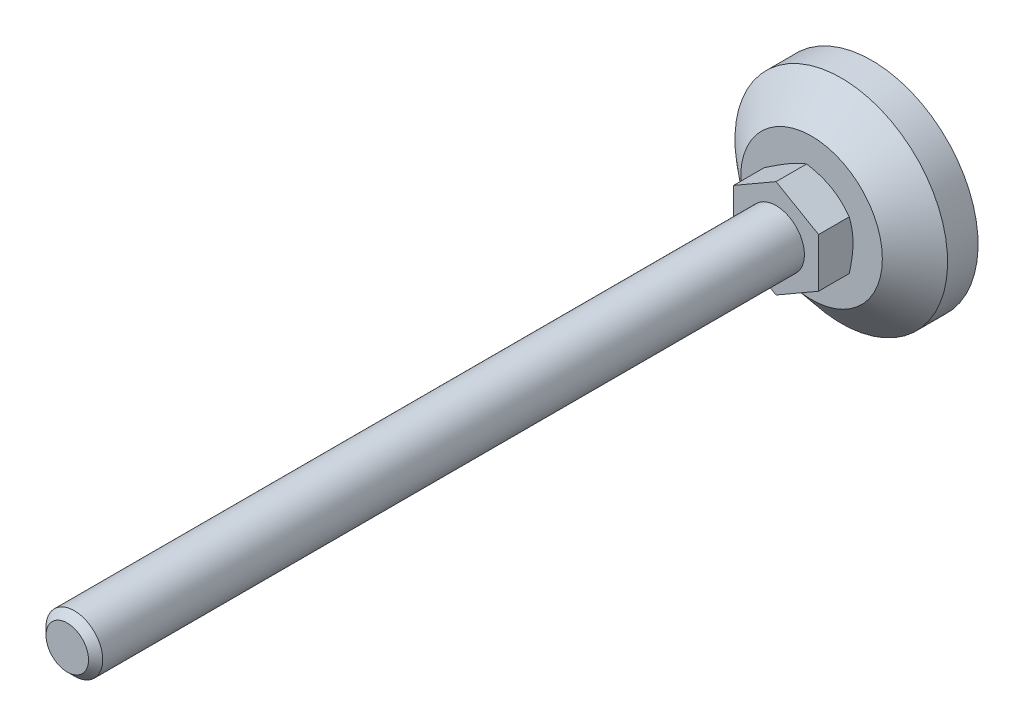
ISO-10303-21;
HEADER;
FILE_DESCRIPTION(('STEP AP214'),'2;1');
FILE_NAME('part.step','',(''),(''),'','','');
FILE_SCHEMA(('AUTOMOTIVE_DESIGN { 1 0 10303 214 1 1 1 1 }'));
ENDSEC;
DATA;
#1=APPLICATION_CONTEXT('core data for automotive mechanical design processes');
#2=APPLICATION_PROTOCOL_DEFINITION('international standard','automotive_design',2000,#1);
#3=PRODUCT_CONTEXT('',#1,'mechanical');
#4=PRODUCT('Part','Part','',(#3));
#5=PRODUCT_RELATED_PRODUCT_CATEGORY('part','',(#4));
#6=PRODUCT_DEFINITION_FORMATION('','',#4);
#7=PRODUCT_DEFINITION_CONTEXT('part definition',#1,'design');
#8=PRODUCT_DEFINITION('design','',#6,#7);
#9=PRODUCT_DEFINITION_SHAPE('','',#8);
#10=(LENGTH_UNIT() NAMED_UNIT(*) SI_UNIT(.MILLI.,.METRE.));
#11=(NAMED_UNIT(*) PLANE_ANGLE_UNIT() SI_UNIT($,.RADIAN.));
#12=(NAMED_UNIT(*) SI_UNIT($,.STERADIAN.) SOLID_ANGLE_UNIT());
#13=UNCERTAINTY_MEASURE_WITH_UNIT(LENGTH_MEASURE(1.E-05),#10,'distance_accuracy_value','');
#14=(GEOMETRIC_REPRESENTATION_CONTEXT(3) GLOBAL_UNCERTAINTY_ASSIGNED_CONTEXT((#13)) GLOBAL_UNIT_ASSIGNED_CONTEXT((#10,
#11,#12)) REPRESENTATION_CONTEXT('',''));
#15=CARTESIAN_POINT('',(0.,0.,0.));
#16=DIRECTION('',(0.,0.,1.));
#17=DIRECTION('',(1.,0.,0.));
#18=AXIS2_PLACEMENT_3D('',#15,#16,#17);
#19=CARTESIAN_POINT('',(0.,0.,27.));
#20=DIRECTION('',(0.,0.,1.));
#21=DIRECTION('',(0.5,-0.866025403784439,0.));
#22=AXIS2_PLACEMENT_3D('',#19,#20,#21);
#23=PLANE('',#22);
#24=DIRECTION('',(0.,1.,0.));
#25=VECTOR('',#24,1.);
#26=CARTESIAN_POINT('',(12.,-6.92820323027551,27.));
#27=LINE('',#26,#25);
#28=CARTESIAN_POINT('',(12.,-6.92820323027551,27.));
#29=VERTEX_POINT('',#28);
#30=CARTESIAN_POINT('',(12.,6.92820323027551,27.));
#31=VERTEX_POINT('',#30);
#32=EDGE_CURVE('E197',#29,#31,#27,.T.);
#33=ORIENTED_EDGE('',*,*,#32,.T.);
#34=DIRECTION('',(-0.866025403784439,0.5,0.));
#35=VECTOR('',#34,1.);
#36=CARTESIAN_POINT('',(12.,6.92820323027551,27.));
#37=LINE('',#36,#35);
#38=CARTESIAN_POINT('',(0.,13.856406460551,27.));
#39=VERTEX_POINT('',#38);
#40=EDGE_CURVE('E320',#31,#39,#37,.T.);
#41=ORIENTED_EDGE('',*,*,#40,.T.);
#42=DIRECTION('',(-0.866025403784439,-0.5,0.));
#43=VECTOR('',#42,1.);
#44=CARTESIAN_POINT('',(0.,13.856406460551,27.));
#45=LINE('',#44,#43);
#46=CARTESIAN_POINT('',(-12.,6.92820323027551,27.));
#47=VERTEX_POINT('',#46);
#48=EDGE_CURVE('E319',#39,#47,#45,.T.);
#49=ORIENTED_EDGE('',*,*,#48,.T.);
#50=DIRECTION('',(0.,-1.,0.));
#51=VECTOR('',#50,1.);
#52=CARTESIAN_POINT('',(-12.,6.92820323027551,27.));
#53=LINE('',#52,#51);
#54=CARTESIAN_POINT('',(-12.,-6.92820323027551,27.));
#55=VERTEX_POINT('',#54);
#56=EDGE_CURVE('E324',#47,#55,#53,.T.);
#57=ORIENTED_EDGE('',*,*,#56,.T.);
#58=DIRECTION('',(0.866025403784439,-0.5,0.));
#59=VECTOR('',#58,1.);
#60=CARTESIAN_POINT('',(-12.,-6.92820323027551,27.));
#61=LINE('',#60,#59);
#62=CARTESIAN_POINT('',(0.,-13.856406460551,27.));
#63=VERTEX_POINT('',#62);
#64=EDGE_CURVE('E326',#55,#63,#61,.T.);
#65=ORIENTED_EDGE('',*,*,#64,.T.);
#66=DIRECTION('',(0.866025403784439,0.5,0.));
#67=VECTOR('',#66,1.);
#68=CARTESIAN_POINT('',(0.,-13.856406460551,27.));
#69=LINE('',#68,#67);
#70=EDGE_CURVE('E37',#63,#29,#69,.T.);
#71=ORIENTED_EDGE('',*,*,#70,.T.);
#72=EDGE_LOOP('',(#33,#41,#49,#57,#65,#71));
#73=FACE_BOUND('',#72,.T.);
#74=CARTESIAN_POINT('',(0.,0.,27.));
#75=DIRECTION('',(0.,0.,1.));
#76=DIRECTION('',(0.5,-0.866025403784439,0.));
#77=AXIS2_PLACEMENT_3D('',#74,#75,#76);
#78=CIRCLE('',#77,8.);
#79=CARTESIAN_POINT('',(4.,-6.92820323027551,27.));
#80=VERTEX_POINT('',#79);
#81=EDGE_CURVE('E201',#80,#80,#78,.T.);
#82=ORIENTED_EDGE('',*,*,#81,.F.);
#83=EDGE_LOOP('',(#82));
#84=FACE_BOUND('',#83,.T.);
#85=ADVANCED_FACE('F14',(#73,#84),#23,.T.);
#86=CARTESIAN_POINT('',(-9.99463491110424,17.3112154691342,17.));
#87=DIRECTION('',(0.,0.,1.));
#88=DIRECTION('',(0.5,-0.866025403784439,0.));
#89=AXIS2_PLACEMENT_3D('',#86,#87,#88);
#90=PLANE('',#89);
#91=CARTESIAN_POINT('',(0.,0.,17.));
#92=DIRECTION('',(0.,0.,-1.));
#93=DIRECTION('',(-0.5,0.866025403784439,0.));
#94=AXIS2_PLACEMENT_3D('',#91,#92,#93);
#95=CIRCLE('',#94,19.9892698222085);
#96=CARTESIAN_POINT('',(-9.99463491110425,17.3112154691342,17.));
#97=VERTEX_POINT('',#96);
#98=EDGE_CURVE('E102',#97,#97,#95,.T.);
#99=ORIENTED_EDGE('',*,*,#98,.F.);
#100=EDGE_LOOP('',(#99));
#101=FACE_BOUND('',#100,.T.);
#102=CARTESIAN_POINT('',(0.,0.,17.));
#103=DIRECTION('',(0.,0.,-1.));
#104=DIRECTION('',(-0.5,0.866025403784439,0.));
#105=AXIS2_PLACEMENT_3D('',#102,#103,#104);
#106=CIRCLE('',#105,11.5);
#107=CARTESIAN_POINT('',(-5.75,9.95929214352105,17.));
#108=VERTEX_POINT('',#107);
#109=EDGE_CURVE('E84',#108,#108,#106,.T.);
#110=ORIENTED_EDGE('',*,*,#109,.T.);
#111=EDGE_LOOP('',(#110));
#112=FACE_BOUND('',#111,.T.);
#113=ADVANCED_FACE('F174',(#101,#112),#90,.T.);
#114=CARTESIAN_POINT('',(0.,0.,0.));
#115=DIRECTION('',(0.,0.,-1.));
#116=DIRECTION('',(-0.5,0.866025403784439,0.));
#117=AXIS2_PLACEMENT_3D('',#114,#115,#116);
#118=PLANE('',#117);
#119=CARTESIAN_POINT('',(0.,0.,0.));
#120=DIRECTION('',(0.,0.,-1.));
#121=DIRECTION('',(-0.5,0.866025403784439,0.));
#122=AXIS2_PLACEMENT_3D('',#119,#120,#121);
#123=CIRCLE('',#122,30.);
#124=CARTESIAN_POINT('',(-15.,25.9807621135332,0.));
#125=VERTEX_POINT('',#124);
#126=EDGE_CURVE('E73',#125,#125,#123,.T.);
#127=ORIENTED_EDGE('',*,*,#126,.T.);
#128=EDGE_LOOP('',(#127));
#129=FACE_BOUND('',#128,.T.);
#130=ADVANCED_FACE('F177',(#129),#118,.T.);
#131=CARTESIAN_POINT('',(0.,0.,-75.4972525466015));
#132=DIRECTION('',(0.,0.,-1.));
#133=DIRECTION('',(-0.5,0.866025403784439,0.));
#134=AXIS2_PLACEMENT_3D('',#131,#132,#133);
#135=CYLINDRICAL_SURFACE('',#134,30.);
#136=CARTESIAN_POINT('',(0.,0.,8.6));
#137=DIRECTION('',(0.,0.,-1.));
#138=DIRECTION('',(-0.5,0.866025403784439,0.));
#139=AXIS2_PLACEMENT_3D('',#136,#137,#138);
#140=CIRCLE('',#139,30.);
#141=CARTESIAN_POINT('',(-15.,25.9807621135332,8.6));
#142=VERTEX_POINT('',#141);
#143=EDGE_CURVE('E105',#142,#142,#140,.T.);
#144=ORIENTED_EDGE('',*,*,#143,.T.);
#145=EDGE_LOOP('',(#144));
#146=FACE_BOUND('',#145,.T.);
#147=ORIENTED_EDGE('',*,*,#126,.F.);
#148=EDGE_LOOP('',(#147));
#149=FACE_BOUND('',#148,.T.);
#150=ADVANCED_FACE('F181',(#146,#149),#135,.T.);
#151=CARTESIAN_POINT('',(0.,0.,8.6));
#152=DIRECTION('',(0.,0.,-1.));
#153=DIRECTION('',(-0.5,0.866025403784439,0.));
#154=AXIS2_PLACEMENT_3D('',#151,#152,#153);
#155=CONICAL_SURFACE('',#154,30.,0.872664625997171);
#156=ORIENTED_EDGE('',*,*,#98,.T.);
#157=EDGE_LOOP('',(#156));
#158=FACE_BOUND('',#157,.T.);
#159=ORIENTED_EDGE('',*,*,#143,.F.);
#160=EDGE_LOOP('',(#159));
#161=FACE_BOUND('',#160,.T.);
#162=ADVANCED_FACE('F121',(#158,#161),#155,.T.);
#163=CARTESIAN_POINT('',(0.,0.,20.8975219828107));
#164=DIRECTION('',(0.,0.,1.));
#165=DIRECTION('',(0.5,-0.866025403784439,0.));
#166=AXIS2_PLACEMENT_3D('',#163,#164,#165);
#167=CONICAL_SURFACE('',#166,18.2507060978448,1.0471975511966);
#168=ORIENTED_EDGE('',*,*,#109,.F.);
#169=EDGE_LOOP('',(#168));
#170=FACE_BOUND('',#169,.T.);
#171=CARTESIAN_POINT('',(-10.1845483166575,-19.7364581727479,23.1830146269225));
#172=CARTESIAN_POINT('',(-9.95731802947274,-19.6052667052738,23.0555465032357));
#173=CARTESIAN_POINT('',(-9.72982292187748,-19.4739223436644,22.9287081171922));
#174=CARTESIAN_POINT('',(-9.27424782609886,-19.2108959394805,22.6764332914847));
#175=CARTESIAN_POINT('',(-9.04616783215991,-19.0792138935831,22.5509968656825));
#176=CARTESIAN_POINT('',(-8.360907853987,-18.6835788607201,22.1769716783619));
#177=CARTESIAN_POINT('',(-7.90277404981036,-18.4190751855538,21.930704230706));
#178=CARTESIAN_POINT('',(-6.98100239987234,-17.8868900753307,21.4445247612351));
#179=CARTESIAN_POINT('',(-6.51734820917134,-17.6191992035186,21.2046539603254));
#180=CARTESIAN_POINT('',(-5.58637620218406,-17.0817022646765,20.734620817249));
#181=CARTESIAN_POINT('',(-5.11905855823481,-16.8118962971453,20.5044580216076));
#182=CARTESIAN_POINT('',(-4.16467967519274,-16.2608853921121,20.0490896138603));
#183=CARTESIAN_POINT('',(-3.67747196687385,-15.9795958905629,19.82429119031));
#184=CARTESIAN_POINT('',(-2.69737824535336,-15.413738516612,19.3915182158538));
#185=CARTESIAN_POINT('',(-2.20449160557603,-15.1291702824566,19.1835455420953));
#186=CARTESIAN_POINT('',(-1.21317256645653,-14.5568319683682,18.7898295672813));
#187=CARTESIAN_POINT('',(-0.714753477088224,-14.2690695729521,18.6040419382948));
#188=CARTESIAN_POINT('',(0.289281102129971,-13.6893899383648,18.2605950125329));
#189=CARTESIAN_POINT('',(0.794894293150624,-13.3974740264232,18.1029269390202));
#190=CARTESIAN_POINT('',(1.55740346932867,-12.9572391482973,17.8936125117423));
#191=CARTESIAN_POINT('',(1.81154649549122,-12.8105096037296,17.82851512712));
#192=CARTESIAN_POINT('',(2.3215816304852,-12.5160406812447,17.7081511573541));
#193=CARTESIAN_POINT('',(2.57747370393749,-12.3683013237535,17.652884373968));
#194=CARTESIAN_POINT('',(3.09083535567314,-12.0719118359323,17.5531523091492));
#195=CARTESIAN_POINT('',(3.34830490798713,-11.9232617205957,17.5086868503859));
#196=CARTESIAN_POINT('',(3.86455433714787,-11.6252049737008,17.4314414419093));
#197=CARTESIAN_POINT('',(4.12333416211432,-11.4757983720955,17.3986610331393));
#198=CARTESIAN_POINT('',(4.63843364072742,-11.1784055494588,17.345852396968));
#199=CARTESIAN_POINT('',(4.89474072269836,-11.0304265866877,17.3256616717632));
#200=CARTESIAN_POINT('',(5.40786438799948,-10.7341745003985,17.2978182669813));
#201=CARTESIAN_POINT('',(5.66468096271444,-10.5859013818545,17.2901653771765));
#202=CARTESIAN_POINT('',(6.17836497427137,-10.2893257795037,17.287579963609));
#203=CARTESIAN_POINT('',(6.43523241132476,-10.1410232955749,17.2926474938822));
#204=CARTESIAN_POINT('',(6.94855188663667,-9.84465815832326,17.3153783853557));
#205=CARTESIAN_POINT('',(7.20500390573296,-9.69659551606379,17.3330423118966));
#206=CARTESIAN_POINT('',(7.81927447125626,-9.34194623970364,17.3900614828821));
#207=CARTESIAN_POINT('',(8.17669346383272,-9.13559028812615,17.4352607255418));
#208=CARTESIAN_POINT('',(8.88892563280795,-8.72438285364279,17.5476838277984));
#209=CARTESIAN_POINT('',(9.24373845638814,-8.51953157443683,17.6149106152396));
#210=CARTESIAN_POINT('',(9.95040329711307,-8.11153843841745,17.7689975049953));
#211=CARTESIAN_POINT('',(10.3022528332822,-7.90839801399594,17.8558726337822));
#212=CARTESIAN_POINT('',(11.0024455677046,-7.50414155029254,18.0466010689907));
#213=CARTESIAN_POINT('',(11.3507888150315,-7.30302548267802,18.1504541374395));
#214=CARTESIAN_POINT('',(12.0517118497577,-6.89834737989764,18.3750877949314));
#215=CARTESIAN_POINT('',(12.4042127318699,-6.69483090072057,18.4961943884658));
#216=CARTESIAN_POINT('',(13.1057427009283,-6.28980238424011,18.7510771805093));
#217=CARTESIAN_POINT('',(13.4547717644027,-6.08829036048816,18.8848534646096));
#218=CARTESIAN_POINT('',(14.1495287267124,-5.68717224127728,19.1629377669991));
#219=CARTESIAN_POINT('',(14.4952576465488,-5.48756555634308,19.3072424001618));
#220=CARTESIAN_POINT('',(15.1838410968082,-5.09001171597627,19.6046702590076));
#221=CARTESIAN_POINT('',(15.5266956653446,-4.89206453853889,19.7577933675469));
#222=CARTESIAN_POINT('',(16.3531119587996,-4.41493286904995,20.1371587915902));
#223=CARTESIAN_POINT('',(16.8353860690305,-4.13649178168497,20.3671360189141));
#224=CARTESIAN_POINT('',(17.7956874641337,-3.58206151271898,20.838658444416));
#225=CARTESIAN_POINT('',(18.2737144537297,-3.3060725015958,21.0802044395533));
#226=CARTESIAN_POINT('',(19.2263411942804,-2.75607319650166,21.572480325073));
#227=CARTESIAN_POINT('',(19.7009400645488,-2.48206341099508,21.8232124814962));
#228=CARTESIAN_POINT('',(20.647182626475,-1.93575001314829,22.3319518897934));
#229=CARTESIAN_POINT('',(21.1188263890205,-1.66344635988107,22.5899589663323));
#230=CARTESIAN_POINT('',(22.060219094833,-1.11993302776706,23.1121588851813));
#231=CARTESIAN_POINT('',(22.5299651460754,-0.848725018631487,23.3763586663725));
#232=CARTESIAN_POINT('',(23.4674052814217,-0.307493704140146,23.9095679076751));
#233=CARTESIAN_POINT('',(23.9350993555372,-0.037470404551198,24.1785773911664));
#234=CARTESIAN_POINT('',(24.8686924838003,0.50153983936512,24.7205226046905));
#235=CARTESIAN_POINT('',(25.3345917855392,0.770526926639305,24.9934577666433));
#236=CARTESIAN_POINT('',(26.2649273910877,1.30765643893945,25.5426344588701));
#237=CARTESIAN_POINT('',(26.7293636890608,1.57579886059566,25.8188760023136));
#238=CARTESIAN_POINT('',(28.0397530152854,2.33235249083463,26.6032315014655));
#239=CARTESIAN_POINT('',(28.8842584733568,2.81992794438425,27.1145698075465));
#240=CARTESIAN_POINT('',(30.5701660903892,3.79328716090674,28.1440983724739));
#241=CARTESIAN_POINT('',(31.4115681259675,4.27907085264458,28.6622889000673));
#242=CARTESIAN_POINT('',(33.0897202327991,5.24795242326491,29.7025139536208));
#243=CARTESIAN_POINT('',(33.9264767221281,5.73105400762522,30.2245346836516));
#244=CARTESIAN_POINT('',(35.1801565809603,6.45486641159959,31.0105887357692));
#245=CARTESIAN_POINT('',(35.5977953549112,6.69599027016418,31.2731029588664));
#246=CARTESIAN_POINT('',(36.4326440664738,7.17799039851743,31.7990373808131));
#247=CARTESIAN_POINT('',(36.8498540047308,7.41886666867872,32.0624575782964));
#248=CARTESIAN_POINT('',(37.2668741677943,7.65963337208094,32.3262778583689));
#249=B_SPLINE_CURVE_WITH_KNOTS('',3,(#171,#172,#173,#174,#175,#176,#177,#178,#179,#180,#181,
#182,#183,#184,#185,#186,#187,#188,#189,#190,#191,#192,#193,#194,#195,#196,#197,#198,#199,#200,
#201,#202,#203,#204,#205,#206,#207,#208,#209,#210,#211,#212,#213,#214,#215,#216,#217,#218,#219,
#220,#221,#222,#223,#224,#225,#226,#227,#228,#229,#230,#231,#232,#233,#234,#235,#236,#237,#238,
#239,#240,#241,#242,#243,#244,#245,#246,#247,#248),.UNSPECIFIED.,.F.,.F.,(4,2,2,2,2,2,2,2,2,2,2,
2,2,2,2,2,2,2,2,2,2,2,2,2,2,2,2,2,2,2,2,2,2,2,2,2,2,2,4),(0.,0.875119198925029,1.75024704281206,
3.50075771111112,5.26066680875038,7.02049360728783,8.8377767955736,10.6552624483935,
12.469053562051,14.2822775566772,15.1839173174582,16.085538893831,16.9871456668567,
17.8887170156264,18.7783966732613,19.6680614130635,20.5577299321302,21.4474383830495,
22.6922901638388,23.9373074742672,25.1832801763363,26.4292354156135,27.7029922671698,
28.9767577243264,30.2501154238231,31.5234562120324,33.3307782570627,35.1382249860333,
36.9461206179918,38.7539727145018,40.5639577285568,42.3739515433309,44.1836860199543,
45.9934277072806,49.2966384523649,52.5999791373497,55.8945808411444,57.5417866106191,
59.1889898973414),.UNSPECIFIED.);
#250=CARTESIAN_POINT('',(0.,-13.856406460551,18.3604719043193));
#251=VERTEX_POINT('',#250);
#252=CARTESIAN_POINT('',(12.,-6.92820323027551,18.3604719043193));
#253=VERTEX_POINT('',#252);
#254=EDGE_CURVE('E65',#251,#253,#249,.T.);
#255=ORIENTED_EDGE('',*,*,#254,.F.);
#256=CARTESIAN_POINT('',(-12.0002,-6.92808776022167,18.3605385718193));
#257=CARTESIAN_POINT('',(-11.7364142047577,-7.08038456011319,18.2726247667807));
#258=CARTESIAN_POINT('',(-11.4716448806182,-7.2332492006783,18.1887011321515));
#259=CARTESIAN_POINT('',(-10.9399829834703,-7.54020434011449,18.0299413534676));
#260=CARTESIAN_POINT('',(-10.6730897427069,-7.69429522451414,17.9551081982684));
#261=CARTESIAN_POINT('',(-9.86810959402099,-8.15905073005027,17.7456926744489));
#262=CARTESIAN_POINT('',(-9.3268449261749,-8.47155003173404,17.6265783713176));
#263=CARTESIAN_POINT('',(-8.51686717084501,-8.93919090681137,17.4869061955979));
#264=CARTESIAN_POINT('',(-8.25057389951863,-9.09293539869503,17.4471189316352));
#265=CARTESIAN_POINT('',(-7.71675440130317,-9.40113622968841,17.3803985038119));
#266=CARTESIAN_POINT('',(-7.44922815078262,-9.55559258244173,17.3534655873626));
#267=CARTESIAN_POINT('',(-6.91372963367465,-9.86476279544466,17.3131437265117));
#268=CARTESIAN_POINT('',(-6.64575827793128,-10.0194761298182,17.2997386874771));
#269=CARTESIAN_POINT('',(-6.10956726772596,-10.3290461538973,17.286758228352));
#270=CARTESIAN_POINT('',(-5.84134762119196,-10.4839028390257,17.2871823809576));
#271=CARTESIAN_POINT('',(-5.33991062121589,-10.7734076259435,17.3008951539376));
#272=CARTESIAN_POINT('',(-5.10665750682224,-10.908076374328,17.3125111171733));
#273=CARTESIAN_POINT('',(-4.64068775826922,-11.1771041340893,17.3459831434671));
#274=CARTESIAN_POINT('',(-4.40797116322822,-11.3114631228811,17.367839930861));
#275=CARTESIAN_POINT('',(-3.94320092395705,-11.5797983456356,17.4214125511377));
#276=CARTESIAN_POINT('',(-3.71114798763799,-11.7137741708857,17.4531365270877));
#277=CARTESIAN_POINT('',(-3.24813003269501,-11.9810977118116,17.5258869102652));
#278=CARTESIAN_POINT('',(-3.01716508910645,-12.1144453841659,17.566913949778));
#279=CARTESIAN_POINT('',(-2.31605804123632,-12.5192297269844,17.7049867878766));
#280=CARTESIAN_POINT('',(-1.84794625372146,-12.789494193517,17.8158000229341));
#281=CARTESIAN_POINT('',(-0.918702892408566,-13.3259930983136,18.0673009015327));
#282=CARTESIAN_POINT('',(-0.457559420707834,-13.5922344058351,18.2079294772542));
#283=CARTESIAN_POINT('',(0.000200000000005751,-13.8565219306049,18.3605385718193));
#284=B_SPLINE_CURVE_WITH_KNOTS('',3,(#256,#257,#258,#259,#260,#261,#262,#263,#264,#265,#266,
#267,#268,#269,#270,#271,#272,#273,#274,#275,#276,#277,#278,#279,#280,#281,#282,#283),
.UNSPECIFIED.,.F.,.F.,(4,2,2,2,2,2,2,2,2,2,2,2,2,4),(0.,0.951004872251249,1.90232158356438,
3.80900466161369,4.73894551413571,5.6689042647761,6.59775529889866,7.52657763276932,
8.3351464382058,9.14377244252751,9.95306755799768,10.7624176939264,12.4167102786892,
14.0677556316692),.UNSPECIFIED.);
#285=CARTESIAN_POINT('',(-12.,-6.92820323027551,18.3604719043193));
#286=VERTEX_POINT('',#285);
#287=EDGE_CURVE('E68',#286,#251,#284,.T.);
#288=ORIENTED_EDGE('',*,*,#287,.F.);
#289=CARTESIAN_POINT('',(-12.,6.92843417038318,18.3605385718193));
#290=CARTESIAN_POINT('',(-12.,6.62384057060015,18.2726247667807));
#291=CARTESIAN_POINT('',(-12.,6.31811128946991,18.1887011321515));
#292=CARTESIAN_POINT('',(-12.,5.70420101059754,18.0299413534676));
#293=CARTESIAN_POINT('',(-12.,5.39601924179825,17.9551081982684));
#294=CARTESIAN_POINT('',(-12.,4.46650823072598,17.7456926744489));
#295=CARTESIAN_POINT('',(-12.,3.84150962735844,17.6265783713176));
#296=CARTESIAN_POINT('',(-12.,2.90622787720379,17.4869061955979));
#297=CARTESIAN_POINT('',(-12.,2.59873889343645,17.4471189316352));
#298=CARTESIAN_POINT('',(-12.,1.98233723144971,17.3803985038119));
#299=CARTESIAN_POINT('',(-12.,1.67342452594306,17.3534655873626));
#300=CARTESIAN_POINT('',(-12.,1.05508409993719,17.3131437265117));
#301=CARTESIAN_POINT('',(-12.,0.745657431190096,17.2997386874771));
#302=CARTESIAN_POINT('',(-12.,0.126517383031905,17.286758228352));
#303=CARTESIAN_POINT('',(-12.,-0.183195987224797,17.2871823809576));
#304=CARTESIAN_POINT('',(-12.,-0.76220556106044,17.3008951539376));
#305=CARTESIAN_POINT('',(-12.,-1.03154305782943,17.3125111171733));
#306=CARTESIAN_POINT('',(-12.,-1.56959857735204,17.3459831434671));
#307=CARTESIAN_POINT('',(-12.,-1.83831655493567,17.367839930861));
#308=CARTESIAN_POINT('',(-12.,-2.37498700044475,17.4214125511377));
#309=CARTESIAN_POINT('',(-12.,-2.64293865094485,17.4531365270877));
#310=CARTESIAN_POINT('',(-12.,-3.17758573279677,17.5258869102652));
#311=CARTESIAN_POINT('',(-12.,-3.44428107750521,17.566913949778));
#312=CARTESIAN_POINT('',(-12.,-4.25384976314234,17.7049867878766));
#313=CARTESIAN_POINT('',(-12.,-4.79437869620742,17.8158000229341));
#314=CARTESIAN_POINT('',(-12.,-5.86737650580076,18.0673009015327));
#315=CARTESIAN_POINT('',(-12.,-6.39985912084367,18.2079294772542));
#316=CARTESIAN_POINT('',(-12.,-6.92843417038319,18.3605385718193));
#317=B_SPLINE_CURVE_WITH_KNOTS('',3,(#289,#290,#291,#292,#293,#294,#295,#296,#297,#298,#299,
#300,#301,#302,#303,#304,#305,#306,#307,#308,#309,#310,#311,#312,#313,#314,#315,#316),
.UNSPECIFIED.,.F.,.F.,(4,2,2,2,2,2,2,2,2,2,2,2,2,4),(0.,0.951004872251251,1.90232158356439,
3.80900466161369,4.73894551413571,5.6689042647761,6.59775529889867,7.52657763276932,
8.3351464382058,9.14377244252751,9.95306755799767,10.7624176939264,12.4167102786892,
14.0677556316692),.UNSPECIFIED.);
#318=CARTESIAN_POINT('',(-12.,6.92820323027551,18.3604719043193));
#319=VERTEX_POINT('',#318);
#320=EDGE_CURVE('E83',#319,#286,#317,.T.);
#321=ORIENTED_EDGE('',*,*,#320,.F.);
#322=CARTESIAN_POINT('',(-22.184548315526,1.04815151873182,23.1830146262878));
#323=CARTESIAN_POINT('',(-21.9573180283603,1.179342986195,23.0555465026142));
#324=CARTESIAN_POINT('',(-21.729822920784,1.31068734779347,22.9287081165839));
#325=CARTESIAN_POINT('',(-21.2742478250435,1.57371375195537,22.676433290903));
#326=CARTESIAN_POINT('',(-21.0461678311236,1.7053957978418,22.550996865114));
#327=CARTESIAN_POINT('',(-20.3609078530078,2.1010308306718,22.1769716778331));
#328=CARTESIAN_POINT('',(-19.9027740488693,2.36553450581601,21.9307042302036));
#329=CARTESIAN_POINT('',(-18.9810023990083,2.89771961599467,21.4445247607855));
#330=CARTESIAN_POINT('',(-18.517348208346,3.16541048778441,21.2046539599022));
#331=CARTESIAN_POINT('',(-17.5863762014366,3.7029074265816,20.7346208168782));
#332=CARTESIAN_POINT('',(-17.1190585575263,3.97271339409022,20.5044580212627));
#333=CARTESIAN_POINT('',(-16.1646796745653,4.52372429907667,20.0490896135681));
#334=CARTESIAN_POINT('',(-15.6774719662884,4.80501380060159,19.8242911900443));
#335=CARTESIAN_POINT('',(-14.6973782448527,5.37087117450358,19.3915182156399));
#336=CARTESIAN_POINT('',(-14.2044916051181,5.65543940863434,19.1835455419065));
#337=CARTESIAN_POINT('',(-13.2131725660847,6.22777772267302,18.7898295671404));
#338=CARTESIAN_POINT('',(-12.7147534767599,6.51554011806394,18.6040419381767));
#339=CARTESIAN_POINT('',(-11.7107188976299,7.09521975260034,18.2605950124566));
#340=CARTESIAN_POINT('',(-11.2051057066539,7.38713566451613,18.1029269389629));
#341=CARTESIAN_POINT('',(-10.4425965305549,7.82737054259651,17.8936125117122));
#342=CARTESIAN_POINT('',(-10.1884535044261,7.97410008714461,17.8285151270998));
#343=CARTESIAN_POINT('',(-9.67841836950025,8.26856900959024,17.7081511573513));
#344=CARTESIAN_POINT('',(-9.42252629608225,8.41630836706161,17.6528843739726));
#345=CARTESIAN_POINT('',(-8.90916464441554,8.71269785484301,17.5531523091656));
#346=CARTESIAN_POINT('',(-8.6516950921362,8.86134797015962,17.5086868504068));
#347=CARTESIAN_POINT('',(-8.13544566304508,9.15940471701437,17.4314414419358));
#348=CARTESIAN_POINT('',(-7.87666583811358,9.30881131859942,17.3986610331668));
#349=CARTESIAN_POINT('',(-7.36156635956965,9.60620414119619,17.3458523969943));
#350=CARTESIAN_POINT('',(-7.10525927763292,9.75418310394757,17.3256616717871));
#351=CARTESIAN_POINT('',(-6.59213561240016,10.0504351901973,17.2978182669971));
#352=CARTESIAN_POINT('',(-6.33531903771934,10.1987083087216,17.2901653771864));
#353=CARTESIAN_POINT('',(-5.82163502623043,10.4952839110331,17.2875799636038));
#354=CARTESIAN_POINT('',(-5.56476758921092,10.6435863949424,17.2926474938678));
#355=CARTESIAN_POINT('',(-5.05144811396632,10.9399515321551,17.3153783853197));
#356=CARTESIAN_POINT('',(-4.79499609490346,11.0880141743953,17.3330423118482));
#357=CARTESIAN_POINT('',(-4.18072552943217,11.4426634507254,17.3900614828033));
#358=CARTESIAN_POINT('',(-3.82330653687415,11.6490194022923,17.4352607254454));
#359=CARTESIAN_POINT('',(-3.11107436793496,12.0602268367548,17.547683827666));
#360=CARTESIAN_POINT('',(-2.75626154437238,12.2650781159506,17.6149106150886));
#361=CARTESIAN_POINT('',(-2.04959670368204,12.67307125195,17.768997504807));
#362=CARTESIAN_POINT('',(-1.69774716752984,12.8762116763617,17.8558726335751));
#363=CARTESIAN_POINT('',(-0.997554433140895,13.2804681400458,18.0466010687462));
#364=CARTESIAN_POINT('',(-0.649211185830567,13.4815842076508,18.1504541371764));
#365=CARTESIAN_POINT('',(0.0517118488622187,13.8862623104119,18.3750877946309));
#366=CARTESIAN_POINT('',(0.404212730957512,14.0897787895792,18.4961943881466));
#367=CARTESIAN_POINT('',(1.10574269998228,14.4948073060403,18.7510771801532));
#368=CARTESIAN_POINT('',(1.45477176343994,14.6963193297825,18.8848534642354));
#369=CARTESIAN_POINT('',(2.1495287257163,15.0974374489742,19.1629377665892));
#370=CARTESIAN_POINT('',(2.49525764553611,15.2970441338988,19.3072423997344));
#371=CARTESIAN_POINT('',(3.18384109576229,15.6945979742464,19.6046702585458));
#372=CARTESIAN_POINT('',(3.52669566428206,15.8925451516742,19.7577933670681));
#373=CARTESIAN_POINT('',(4.3531119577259,16.3696768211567,20.1371587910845));
#374=CARTESIAN_POINT('',(4.83538606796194,16.6481179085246,20.3671360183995));
#375=CARTESIAN_POINT('',(5.7956874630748,17.2025481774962,20.838658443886));
#376=CARTESIAN_POINT('',(6.27371445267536,17.478537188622,21.0802044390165));
#377=CARTESIAN_POINT('',(7.22634119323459,18.0285364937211,21.5724803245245));
#378=CARTESIAN_POINT('',(7.7009400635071,18.30254627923,21.8232124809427));
#379=CARTESIAN_POINT('',(8.64718262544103,18.8488596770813,22.3319518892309));
#380=CARTESIAN_POINT('',(9.11882638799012,19.1211633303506,22.589958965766));
#381=CARTESIAN_POINT('',(10.0602190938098,19.6646766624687,23.1121588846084));
#382=CARTESIAN_POINT('',(10.5299651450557,19.9358846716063,23.3763586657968));
#383=CARTESIAN_POINT('',(11.4674052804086,20.4771159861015,23.9095679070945));
#384=CARTESIAN_POINT('',(11.9350993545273,20.7471392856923,24.1785773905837));
#385=CARTESIAN_POINT('',(12.8686924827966,21.2861495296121,24.7205226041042));
#386=CARTESIAN_POINT('',(13.3345917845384,21.555136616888,24.9934577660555));
#387=CARTESIAN_POINT('',(14.2649273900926,22.0922661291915,25.5426344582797));
#388=CARTESIAN_POINT('',(14.7293636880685,22.3604085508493,25.8188760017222));
#389=CARTESIAN_POINT('',(16.0397530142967,23.1169621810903,26.6032315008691));
#390=CARTESIAN_POINT('',(16.8842584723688,23.6045376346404,27.1145698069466));
#391=CARTESIAN_POINT('',(18.5701660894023,24.5778968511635,28.1440983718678));
#392=CARTESIAN_POINT('',(19.411568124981,25.0636805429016,28.6622888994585));
#393=CARTESIAN_POINT('',(21.0897202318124,26.0325621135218,29.7025139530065));
#394=CARTESIAN_POINT('',(21.9264767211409,26.5156636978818,30.2245346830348));
#395=CARTESIAN_POINT('',(23.1801565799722,27.2394761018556,31.0105887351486));
#396=CARTESIAN_POINT('',(23.5977953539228,27.48059996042,31.2731029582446));
#397=CARTESIAN_POINT('',(24.4326440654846,27.9626000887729,31.799037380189));
#398=CARTESIAN_POINT('',(24.8498540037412,28.2034763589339,32.0624575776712));
#399=CARTESIAN_POINT('',(25.2668741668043,28.4442430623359,32.3262778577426));
#400=B_SPLINE_CURVE_WITH_KNOTS('',3,(#322,#323,#324,#325,#326,#327,#328,#329,#330,#331,#332,
#333,#334,#335,#336,#337,#338,#339,#340,#341,#342,#343,#344,#345,#346,#347,#348,#349,#350,#351,
#352,#353,#354,#355,#356,#357,#358,#359,#360,#361,#362,#363,#364,#365,#366,#367,#368,#369,#370,
#371,#372,#373,#374,#375,#376,#377,#378,#379,#380,#381,#382,#383,#384,#385,#386,#387,#388,#389,
#390,#391,#392,#393,#394,#395,#396,#397,#398,#399),.UNSPECIFIED.,.F.,.F.,(4,2,2,2,2,2,2,2,2,2,2,
2,2,2,2,2,2,2,2,2,2,2,2,2,2,2,2,2,2,2,2,2,2,2,2,2,2,2,4),(0.,0.875119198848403,1.7502470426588,
3.50075771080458,5.2606668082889,7.02049360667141,8.83777679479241,10.6552624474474,
12.4690535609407,14.2822775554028,15.183917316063,16.085538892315,16.9871456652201,
17.8887170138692,18.7783966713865,19.668061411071,20.55772993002,21.4474383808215,
22.6922901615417,23.9373074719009,25.1832801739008,26.4292354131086,27.7029922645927,
28.9767577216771,30.2501154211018,31.523456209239,33.3307782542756,35.1382249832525,
36.9461206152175,38.7539727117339,40.5639577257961,42.3739515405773,44.1836860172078,
45.9934277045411,49.2966384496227,52.5999791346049,55.8945808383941,57.541786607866,
59.1889898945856),.UNSPECIFIED.);
#401=CARTESIAN_POINT('',(0.,13.856406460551,18.3604719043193));
#402=VERTEX_POINT('',#401);
#403=EDGE_CURVE('E143',#402,#319,#400,.F.);
#404=ORIENTED_EDGE('',*,*,#403,.F.);
#405=CARTESIAN_POINT('',(12.0002,6.92808776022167,18.3605385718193));
#406=CARTESIAN_POINT('',(11.7364142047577,7.08038456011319,18.2726247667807));
#407=CARTESIAN_POINT('',(11.4716448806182,7.2332492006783,18.1887011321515));
#408=CARTESIAN_POINT('',(10.9399829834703,7.54020434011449,18.0299413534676));
#409=CARTESIAN_POINT('',(10.6730897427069,7.69429522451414,17.9551081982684));
#410=CARTESIAN_POINT('',(9.86810959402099,8.15905073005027,17.7456926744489));
#411=CARTESIAN_POINT('',(9.3268449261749,8.47155003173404,17.6265783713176));
#412=CARTESIAN_POINT('',(8.51686717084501,8.93919090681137,17.4869061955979));
#413=CARTESIAN_POINT('',(8.25057389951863,9.09293539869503,17.4471189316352));
#414=CARTESIAN_POINT('',(7.71675440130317,9.40113622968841,17.3803985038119));
#415=CARTESIAN_POINT('',(7.44922815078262,9.55559258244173,17.3534655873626));
#416=CARTESIAN_POINT('',(6.91372963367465,9.86476279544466,17.3131437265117));
#417=CARTESIAN_POINT('',(6.64575827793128,10.0194761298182,17.2997386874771));
#418=CARTESIAN_POINT('',(6.10956726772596,10.3290461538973,17.286758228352));
#419=CARTESIAN_POINT('',(5.84134762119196,10.4839028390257,17.2871823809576));
#420=CARTESIAN_POINT('',(5.33991062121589,10.7734076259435,17.3008951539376));
#421=CARTESIAN_POINT('',(5.10665750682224,10.908076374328,17.3125111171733));
#422=CARTESIAN_POINT('',(4.64068775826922,11.1771041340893,17.3459831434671));
#423=CARTESIAN_POINT('',(4.40797116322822,11.3114631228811,17.367839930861));
#424=CARTESIAN_POINT('',(3.94320092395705,11.5797983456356,17.4214125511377));
#425=CARTESIAN_POINT('',(3.71114798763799,11.7137741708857,17.4531365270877));
#426=CARTESIAN_POINT('',(3.24813003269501,11.9810977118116,17.5258869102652));
#427=CARTESIAN_POINT('',(3.01716508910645,12.1144453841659,17.566913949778));
#428=CARTESIAN_POINT('',(2.31605804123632,12.5192297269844,17.7049867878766));
#429=CARTESIAN_POINT('',(1.84794625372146,12.789494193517,17.8158000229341));
#430=CARTESIAN_POINT('',(0.918702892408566,13.3259930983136,18.0673009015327));
#431=CARTESIAN_POINT('',(0.457559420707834,13.5922344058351,18.2079294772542));
#432=CARTESIAN_POINT('',(-0.000200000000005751,13.8565219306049,18.3605385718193));
#433=B_SPLINE_CURVE_WITH_KNOTS('',3,(#405,#406,#407,#408,#409,#410,#411,#412,#413,#414,#415,
#416,#417,#418,#419,#420,#421,#422,#423,#424,#425,#426,#427,#428,#429,#430,#431,#432),
.UNSPECIFIED.,.F.,.F.,(4,2,2,2,2,2,2,2,2,2,2,2,2,4),(0.,0.951004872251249,1.90232158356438,
3.80900466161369,4.73894551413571,5.6689042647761,6.59775529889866,7.52657763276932,
8.3351464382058,9.14377244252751,9.95306755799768,10.7624176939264,12.4167102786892,
14.0677556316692),.UNSPECIFIED.);
#434=CARTESIAN_POINT('',(12.,6.92820323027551,18.3604719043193));
#435=VERTEX_POINT('',#434);
#436=EDGE_CURVE('E150',#435,#402,#433,.T.);
#437=ORIENTED_EDGE('',*,*,#436,.F.);
#438=CARTESIAN_POINT('',(12.,-6.92843417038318,18.3605385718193));
#439=CARTESIAN_POINT('',(12.,-6.62384057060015,18.2726247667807));
#440=CARTESIAN_POINT('',(12.,-6.31811128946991,18.1887011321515));
#441=CARTESIAN_POINT('',(12.,-5.70420101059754,18.0299413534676));
#442=CARTESIAN_POINT('',(12.,-5.39601924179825,17.9551081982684));
#443=CARTESIAN_POINT('',(12.,-4.46650823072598,17.7456926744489));
#444=CARTESIAN_POINT('',(12.,-3.84150962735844,17.6265783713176));
#445=CARTESIAN_POINT('',(12.,-2.90622787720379,17.4869061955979));
#446=CARTESIAN_POINT('',(12.,-2.59873889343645,17.4471189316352));
#447=CARTESIAN_POINT('',(12.,-1.98233723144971,17.3803985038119));
#448=CARTESIAN_POINT('',(12.,-1.67342452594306,17.3534655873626));
#449=CARTESIAN_POINT('',(12.,-1.05508409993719,17.3131437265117));
#450=CARTESIAN_POINT('',(12.,-0.745657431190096,17.2997386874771));
#451=CARTESIAN_POINT('',(12.,-0.126517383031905,17.286758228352));
#452=CARTESIAN_POINT('',(12.,0.183195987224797,17.2871823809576));
#453=CARTESIAN_POINT('',(12.,0.76220556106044,17.3008951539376));
#454=CARTESIAN_POINT('',(12.,1.03154305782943,17.3125111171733));
#455=CARTESIAN_POINT('',(12.,1.56959857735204,17.3459831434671));
#456=CARTESIAN_POINT('',(12.,1.83831655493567,17.367839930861));
#457=CARTESIAN_POINT('',(12.,2.37498700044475,17.4214125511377));
#458=CARTESIAN_POINT('',(12.,2.64293865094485,17.4531365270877));
#459=CARTESIAN_POINT('',(12.,3.17758573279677,17.5258869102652));
#460=CARTESIAN_POINT('',(12.,3.44428107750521,17.566913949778));
#461=CARTESIAN_POINT('',(12.,4.25384976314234,17.7049867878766));
#462=CARTESIAN_POINT('',(12.,4.79437869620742,17.8158000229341));
#463=CARTESIAN_POINT('',(12.,5.86737650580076,18.0673009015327));
#464=CARTESIAN_POINT('',(12.,6.39985912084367,18.2079294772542));
#465=CARTESIAN_POINT('',(12.,6.92843417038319,18.3605385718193));
#466=B_SPLINE_CURVE_WITH_KNOTS('',3,(#438,#439,#440,#441,#442,#443,#444,#445,#446,#447,#448,
#449,#450,#451,#452,#453,#454,#455,#456,#457,#458,#459,#460,#461,#462,#463,#464,#465),
.UNSPECIFIED.,.F.,.F.,(4,2,2,2,2,2,2,2,2,2,2,2,2,4),(0.,0.951004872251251,1.90232158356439,
3.80900466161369,4.73894551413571,5.6689042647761,6.59775529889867,7.52657763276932,
8.3351464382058,9.14377244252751,9.95306755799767,10.7624176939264,12.4167102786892,
14.0677556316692),.UNSPECIFIED.);
#467=EDGE_CURVE('E29',#253,#435,#466,.T.);
#468=ORIENTED_EDGE('',*,*,#467,.F.);
#469=EDGE_LOOP('',(#255,#288,#321,#404,#437,#468));
#470=FACE_BOUND('',#469,.T.);
#471=ADVANCED_FACE('F67',(#170,#470),#167,.T.);
#472=CARTESIAN_POINT('',(0.,-13.856406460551,27.));
#473=DIRECTION('',(-0.5,0.866025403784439,0.));
#474=DIRECTION('',(-0.866025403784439,-0.5,0.));
#475=AXIS2_PLACEMENT_3D('',#472,#473,#474);
#476=PLANE('',#475);
#477=DIRECTION('',(0.,0.,-1.));
#478=VECTOR('',#477,1.);
#479=CARTESIAN_POINT('',(0.,-13.856406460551,27.));
#480=LINE('',#479,#478);
#481=EDGE_CURVE('E80',#63,#251,#480,.T.);
#482=ORIENTED_EDGE('',*,*,#481,.T.);
#483=ORIENTED_EDGE('',*,*,#254,.T.);
#484=DIRECTION('',(0.,0.,-1.));
#485=VECTOR('',#484,1.);
#486=CARTESIAN_POINT('',(12.,-6.92820323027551,27.));
#487=LINE('',#486,#485);
#488=EDGE_CURVE('E87',#29,#253,#487,.T.);
#489=ORIENTED_EDGE('',*,*,#488,.F.);
#490=ORIENTED_EDGE('',*,*,#70,.F.);
#491=EDGE_LOOP('',(#482,#483,#489,#490));
#492=FACE_BOUND('',#491,.T.);
#493=ADVANCED_FACE('F86',(#492),#476,.F.);
#494=CARTESIAN_POINT('',(-12.,-6.92820323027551,27.));
#495=DIRECTION('',(0.5,0.866025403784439,0.));
#496=DIRECTION('',(-0.866025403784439,0.5,0.));
#497=AXIS2_PLACEMENT_3D('',#494,#495,#496);
#498=PLANE('',#497);
#499=DIRECTION('',(0.,0.,-1.));
#500=VECTOR('',#499,1.);
#501=CARTESIAN_POINT('',(-12.,-6.92820323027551,27.));
#502=LINE('',#501,#500);
#503=EDGE_CURVE('E82',#55,#286,#502,.T.);
#504=ORIENTED_EDGE('',*,*,#503,.T.);
#505=ORIENTED_EDGE('',*,*,#287,.T.);
#506=ORIENTED_EDGE('',*,*,#481,.F.);
#507=ORIENTED_EDGE('',*,*,#64,.F.);
#508=EDGE_LOOP('',(#504,#505,#506,#507));
#509=FACE_BOUND('',#508,.T.);
#510=ADVANCED_FACE('F78',(#509),#498,.F.);
#511=CARTESIAN_POINT('',(-12.,6.92820323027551,27.));
#512=DIRECTION('',(1.,0.,0.));
#513=DIRECTION('',(0.,1.,0.));
#514=AXIS2_PLACEMENT_3D('',#511,#512,#513);
#515=PLANE('',#514);
#516=DIRECTION('',(0.,0.,-1.));
#517=VECTOR('',#516,1.);
#518=CARTESIAN_POINT('',(-12.,6.92820323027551,27.));
#519=LINE('',#518,#517);
#520=EDGE_CURVE('E89',#47,#319,#519,.T.);
#521=ORIENTED_EDGE('',*,*,#520,.T.);
#522=ORIENTED_EDGE('',*,*,#320,.T.);
#523=ORIENTED_EDGE('',*,*,#503,.F.);
#524=ORIENTED_EDGE('',*,*,#56,.F.);
#525=EDGE_LOOP('',(#521,#522,#523,#524));
#526=FACE_BOUND('',#525,.T.);
#527=ADVANCED_FACE('F297',(#526),#515,.F.);
#528=CARTESIAN_POINT('',(0.,13.856406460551,27.));
#529=DIRECTION('',(0.5,-0.866025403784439,0.));
#530=DIRECTION('',(0.866025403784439,0.5,0.));
#531=AXIS2_PLACEMENT_3D('',#528,#529,#530);
#532=PLANE('',#531);
#533=DIRECTION('',(0.,0.,-1.));
#534=VECTOR('',#533,1.);
#535=CARTESIAN_POINT('',(0.,13.856406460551,27.));
#536=LINE('',#535,#534);
#537=EDGE_CURVE('E96',#39,#402,#536,.T.);
#538=ORIENTED_EDGE('',*,*,#537,.T.);
#539=ORIENTED_EDGE('',*,*,#403,.T.);
#540=ORIENTED_EDGE('',*,*,#520,.F.);
#541=ORIENTED_EDGE('',*,*,#48,.F.);
#542=EDGE_LOOP('',(#538,#539,#540,#541));
#543=FACE_BOUND('',#542,.T.);
#544=ADVANCED_FACE('F167',(#543),#532,.F.);
#545=CARTESIAN_POINT('',(12.,6.92820323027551,27.));
#546=DIRECTION('',(-0.5,-0.866025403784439,0.));
#547=DIRECTION('',(0.866025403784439,-0.5,0.));
#548=AXIS2_PLACEMENT_3D('',#545,#546,#547);
#549=PLANE('',#548);
#550=DIRECTION('',(0.,0.,-1.));
#551=VECTOR('',#550,1.);
#552=CARTESIAN_POINT('',(12.,6.92820323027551,27.));
#553=LINE('',#552,#551);
#554=EDGE_CURVE('E99',#31,#435,#553,.T.);
#555=ORIENTED_EDGE('',*,*,#554,.T.);
#556=ORIENTED_EDGE('',*,*,#436,.T.);
#557=ORIENTED_EDGE('',*,*,#537,.F.);
#558=ORIENTED_EDGE('',*,*,#40,.F.);
#559=EDGE_LOOP('',(#555,#556,#557,#558));
#560=FACE_BOUND('',#559,.T.);
#561=ADVANCED_FACE('F163',(#560),#549,.F.);
#562=CARTESIAN_POINT('',(12.,-6.92820323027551,27.));
#563=DIRECTION('',(-1.,0.,0.));
#564=DIRECTION('',(0.,-1.,0.));
#565=AXIS2_PLACEMENT_3D('',#562,#563,#564);
#566=PLANE('',#565);
#567=ORIENTED_EDGE('',*,*,#488,.T.);
#568=ORIENTED_EDGE('',*,*,#467,.T.);
#569=ORIENTED_EDGE('',*,*,#554,.F.);
#570=ORIENTED_EDGE('',*,*,#32,.F.);
#571=EDGE_LOOP('',(#567,#568,#569,#570));
#572=FACE_BOUND('',#571,.T.);
#573=ADVANCED_FACE('F166',(#572),#566,.F.);
#574=CARTESIAN_POINT('',(0.,0.,227.));
#575=DIRECTION('',(0.,0.,-1.));
#576=DIRECTION('',(-0.5,0.866025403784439,0.));
#577=AXIS2_PLACEMENT_3D('',#574,#575,#576);
#578=CYLINDRICAL_SURFACE('',#577,8.);
#579=CARTESIAN_POINT('',(0.,0.,225.));
#580=DIRECTION('',(0.,0.,1.));
#581=DIRECTION('',(0.5,-0.866025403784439,0.));
#582=AXIS2_PLACEMENT_3D('',#579,#580,#581);
#583=CIRCLE('',#582,8.);
#584=CARTESIAN_POINT('',(4.,-6.92820323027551,225.));
#585=VERTEX_POINT('',#584);
#586=EDGE_CURVE('E9',#585,#585,#583,.F.);
#587=ORIENTED_EDGE('',*,*,#586,.T.);
#588=EDGE_LOOP('',(#587));
#589=FACE_BOUND('',#588,.T.);
#590=ORIENTED_EDGE('',*,*,#81,.T.);
#591=EDGE_LOOP('',(#590));
#592=FACE_BOUND('',#591,.T.);
#593=ADVANCED_FACE('F123',(#589,#592),#578,.T.);
#594=CARTESIAN_POINT('',(0.,0.,227.));
#595=DIRECTION('',(0.,0.,1.));
#596=DIRECTION('',(0.5,-0.866025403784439,0.));
#597=AXIS2_PLACEMENT_3D('',#594,#595,#596);
#598=PLANE('',#597);
#599=CARTESIAN_POINT('',(0.,0.,227.));
#600=DIRECTION('',(0.,0.,1.));
#601=DIRECTION('',(0.5,-0.866025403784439,0.));
#602=AXIS2_PLACEMENT_3D('',#599,#600,#601);
#603=CIRCLE('',#602,6.);
#604=CARTESIAN_POINT('',(3.,-5.19615242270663,227.));
#605=VERTEX_POINT('',#604);
#606=EDGE_CURVE('E22',#605,#605,#603,.T.);
#607=ORIENTED_EDGE('',*,*,#606,.T.);
#608=EDGE_LOOP('',(#607));
#609=FACE_BOUND('',#608,.T.);
#610=ADVANCED_FACE('F208',(#609),#598,.T.);
#611=CARTESIAN_POINT('',(0.,0.,227.));
#612=DIRECTION('',(0.,0.,-1.));
#613=DIRECTION('',(-0.5,0.866025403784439,0.));
#614=AXIS2_PLACEMENT_3D('',#611,#612,#613);
#615=CONICAL_SURFACE('',#614,6.,0.785398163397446);
#616=ORIENTED_EDGE('',*,*,#586,.F.);
#617=EDGE_LOOP('',(#616));
#618=FACE_BOUND('',#617,.T.);
#619=ORIENTED_EDGE('',*,*,#606,.F.);
#620=EDGE_LOOP('',(#619));
#621=FACE_BOUND('',#620,.T.);
#622=ADVANCED_FACE('F16',(#618,#621),#615,.T.);
#623=CLOSED_SHELL('',(#85,#113,#130,#150,#162,#471,#493,#510,#527,#544,#561,#573,#593,#610,#622));
#624=MANIFOLD_SOLID_BREP('B1',#623);
#625=ADVANCED_BREP_SHAPE_REPRESENTATION('',(#18,#624),#14);
#626=SHAPE_DEFINITION_REPRESENTATION(#9,#625);
ENDSEC;
END-ISO-10303-21;
